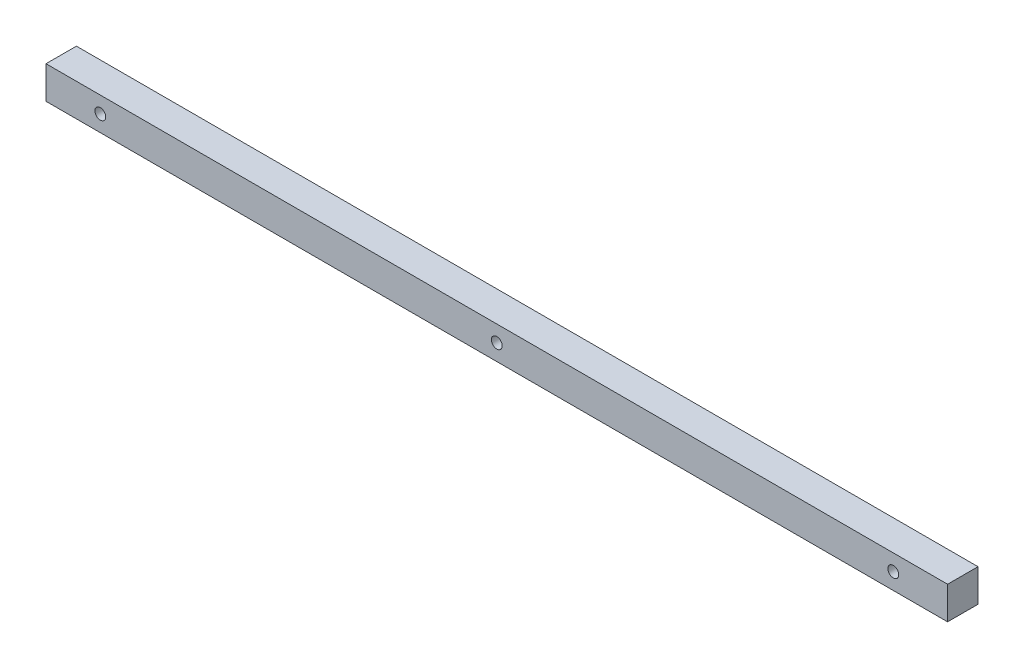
from build123d import *

# Parameters (mm, degrees)
SKETCH_1_W      = 830
SKETCH_1_H      = 30
SKETCH_1_R      = 5
EXTRUDE_1_DEPTH = 28


with BuildPart() as part:
    # Sketch 1 → Extrude 1 (new body)
    with BuildSketch(Plane.XY):
        Rectangle(SKETCH_1_W, SKETCH_1_H)
        with Locations((-365, 0)):
            Circle(SKETCH_1_R, mode=Mode.SUBTRACT)
        Circle(SKETCH_1_R, mode=Mode.SUBTRACT)
        with Locations((365, 0)):
            Circle(SKETCH_1_R, mode=Mode.SUBTRACT)
    extrude(amount=EXTRUDE_1_DEPTH)


solid = part.part
